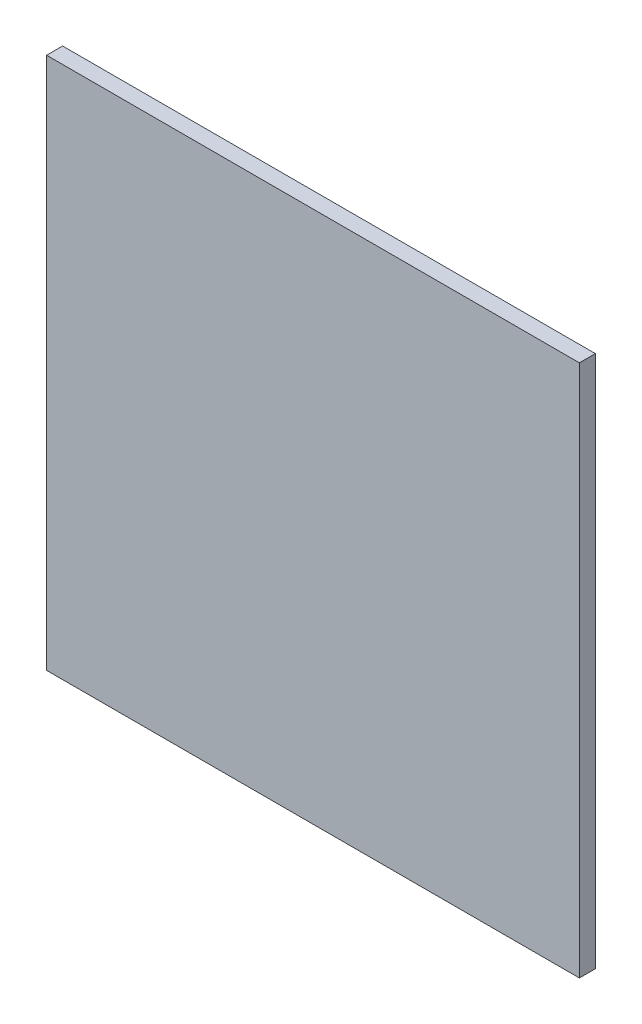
from build123d import *

# Parameters (mm, degrees)
CROQUIS1_W              = 500
CROQUIS1_H              = 500
SALIENTE_EXTRUIR1_DEPTH = 15


with BuildPart() as part:
    # Croquis1 → Saliente-Extruir1 (new body)
    with BuildSketch(Plane.XY):
        Rectangle(CROQUIS1_W, CROQUIS1_H)
    extrude(amount=SALIENTE_EXTRUIR1_DEPTH)


solid = part.part
